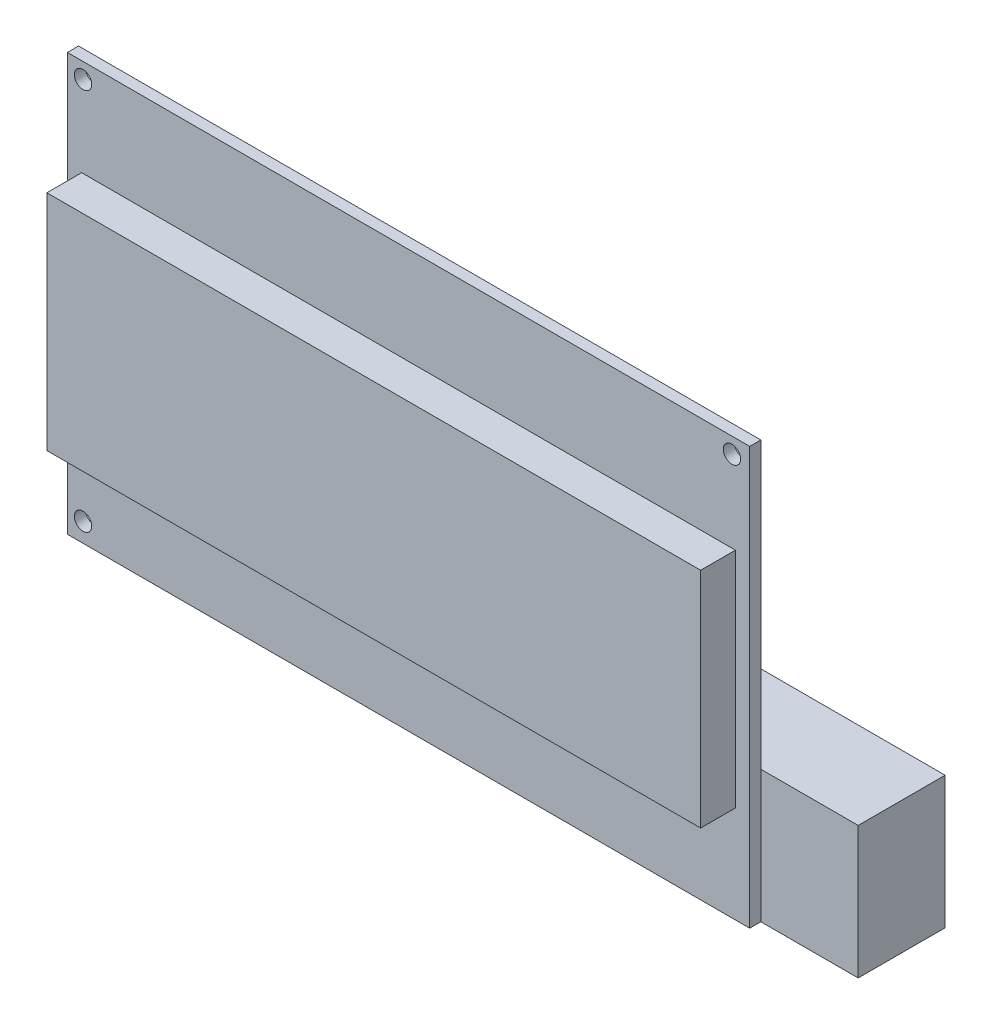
from build123d import *

# Parameters (mm, degrees)
ESQUISSE1_W             = 98.1
ESQUISSE1_H             = 60
BOSS_EXTRU_1_DEPTH      = 1.6
ESQUISSE2_W             = 94
ESQUISSE2_H             = 32.1
BOSS_EXTRU_2_DEPTH      = 5
ESQUISSE3_W             = 58
ESQUISSE3_H             = 19
BOSS_EXTRU_3_DEPTH      = 12.5
ENL_V_MAT_EXTRU_1_REACH = 129.76
ESQUISSE4_R             = 1.25
ESQUISSE5_W             = 2
ESQUISSE5_H             = 8
BOSS_EXTRU_4_DEPTH      = 6


with BuildPart() as part:
    # Esquisse1 → Boss.-Extru.1 (new body)
    with BuildSketch(Plane.XY):
        with Locations((49.05, 30)):
            Rectangle(ESQUISSE1_W, ESQUISSE1_H)
    extrude(amount=BOSS_EXTRU_1_DEPTH)

    # Esquisse2 → Boss.-Extru.2 (add)
    with BuildSketch(Plane.XY.offset(1.6)):
        with Locations((49.05, 30)):
            Rectangle(ESQUISSE2_W, ESQUISSE2_H)
    extrude(amount=BOSS_EXTRU_2_DEPTH)

    # Esquisse3 → Boss.-Extru.3 (add)
    with BuildSketch(Plane(origin=(0, 0, 0), x_dir=(-1, 0, 0), z_dir=(0, 0, -1))):
        with Locations((-83.1, 9.5)):
            Rectangle(ESQUISSE3_W, ESQUISSE3_H)
    extrude(amount=BOSS_EXTRU_3_DEPTH)

    # Esquisse4 → Enl_v. mat.-Extru.1 (cut, up to next)
    with BuildSketch(Plane(origin=(0, 0, 0), x_dir=(-1, 0, 0), z_dir=(0, 0, -1)), mode=Mode.PRIVATE) as enl_v_mat_extru_1_sk1:
        with Locations((-2.25, 57.75)):
            Circle(ESQUISSE4_R)
    enl_v_mat_extru_1_tool1 = extrude(enl_v_mat_extru_1_sk1.sketch, amount=-ENL_V_MAT_EXTRU_1_REACH, mode=Mode.PRIVATE) & part.part
    # Esquisse4 → Enl_v. mat.-Extru.1 (cut, up to next)
    with BuildSketch(Plane(origin=(0, 0, 0), x_dir=(-1, 0, 0), z_dir=(0, 0, -1)), mode=Mode.PRIVATE) as enl_v_mat_extru_1_sk2:
        with Locations((-95.55, 57.75)):
            Circle(ESQUISSE4_R)
    enl_v_mat_extru_1_tool2 = extrude(enl_v_mat_extru_1_sk2.sketch, amount=-ENL_V_MAT_EXTRU_1_REACH, mode=Mode.PRIVATE) & part.part
    # Esquisse4 → Enl_v. mat.-Extru.1 (cut, up to next)
    with BuildSketch(Plane(origin=(0, 0, 0), x_dir=(-1, 0, 0), z_dir=(0, 0, -1)), mode=Mode.PRIVATE) as enl_v_mat_extru_1_sk3:
        with Locations((-2.25, 2.75)):
            Circle(ESQUISSE4_R)
    enl_v_mat_extru_1_tool3 = extrude(enl_v_mat_extru_1_sk3.sketch, amount=-ENL_V_MAT_EXTRU_1_REACH, mode=Mode.PRIVATE) & part.part
    add(enl_v_mat_extru_1_tool1.solids().sort_by_distance((2.25, 57.75, 0))[0], mode=Mode.SUBTRACT)
    add(enl_v_mat_extru_1_tool2.solids().sort_by_distance((95.55, 57.75, 0))[0], mode=Mode.SUBTRACT)
    add(enl_v_mat_extru_1_tool3.solids().sort_by_distance((2.25, 2.75, 0))[0], mode=Mode.SUBTRACT)

    # Esquisse5 → Boss.-Extru.4 (add)
    with BuildSketch(Plane.ZY.offset(-54.1)):
        with Locations((-6.5, 8.894315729)):
            Rectangle(ESQUISSE5_W, ESQUISSE5_H)
    extrude(amount=BOSS_EXTRU_4_DEPTH)


solid = part.part
